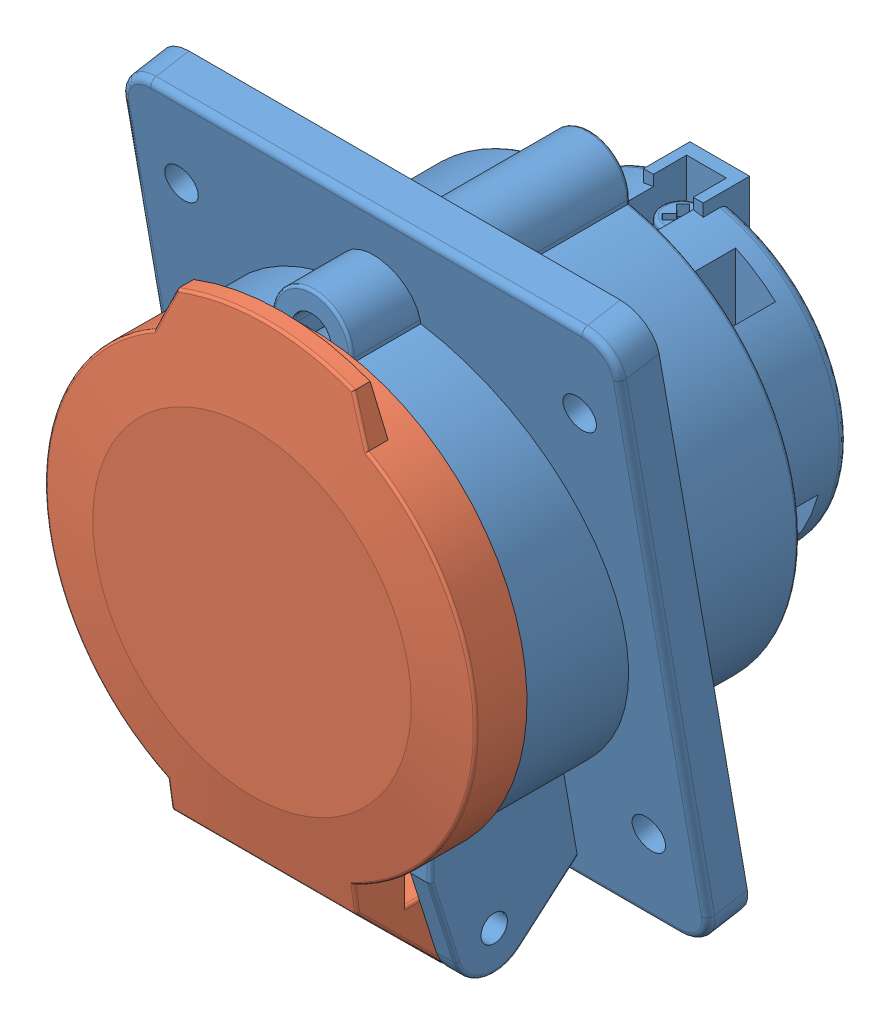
SolidWorks assembly Сборка 415-16.SLDASM, configuration По умолчанию (file format 10000). Lengths in mm.
Overall size (75 93.5 70.5).
2 component instances, 2 part files, 3 mates.
Components (placement in the parent):
- Корпус 415-1: Корпус 415.SLDPRT [По умолчанию] at (61.2325 43.0062 34.0111) size (75 93.5 61.52)
- Крышка 415, 414, 413-1: Крышка 415, 414, 413.SLDPRT [По умолчанию] at (61.2325 43.0062 85.0111) x (0 -1 0) z (0 0 -1) size (85 64.9 25)
Mates (geometry in assembly coordinates):
- Концентричный1: concentric anti-aligned: cylinder of Корпус 415-1 through (61.2325 43.0062 76.0111) axis (0 0 -1) radius 31.5; cylinder of Крышка 415, 414, 413-1 through (61.2325 43.0062 62.0111) axis (0 0 1) radius 32.4495
- Параллельность1: parallel aligned: plane of Корпус 415-1 through (98.7325 43.0062 34.0111) normal (1 0 0); plane of Крышка 415, 414, 413-1 through (75.2325 1.0062 66.0111) normal (1 0 0)
- Совпадение1: coincident anti-aligned: plane of Корпус 415-1 through (61.2325 43.0062 76.0111) normal (0 0 1); plane of Крышка 415, 414, 413-1 through (61.2325 43.0062 76.0111) normal (0 0 -1)
